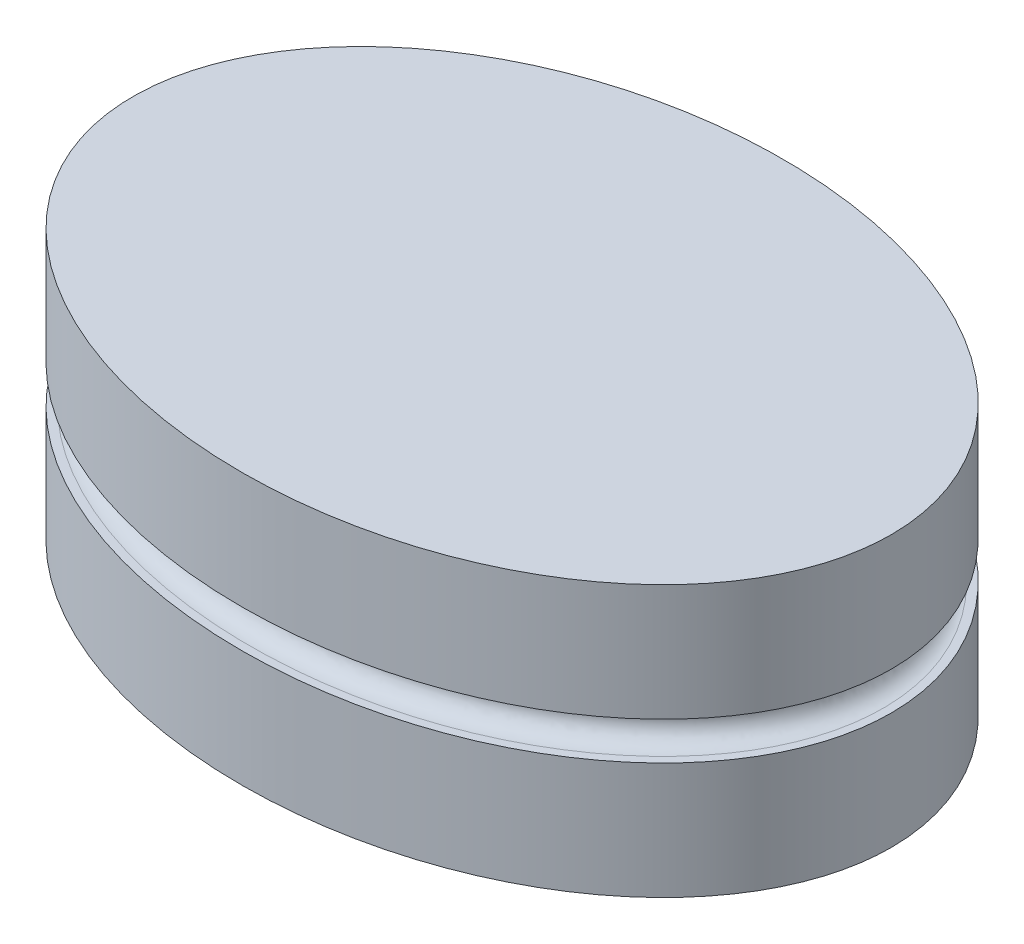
ISO-10303-21;
HEADER;
FILE_DESCRIPTION(('STEP AP214'),'2;1');
FILE_NAME('part.step','',(''),(''),'','','');
FILE_SCHEMA(('AUTOMOTIVE_DESIGN { 1 0 10303 214 1 1 1 1 }'));
ENDSEC;
DATA;
#1=APPLICATION_CONTEXT('core data for automotive mechanical design processes');
#2=APPLICATION_PROTOCOL_DEFINITION('international standard','automotive_design',2000,#1);
#3=PRODUCT_CONTEXT('',#1,'mechanical');
#4=PRODUCT('Part','Part','',(#3));
#5=PRODUCT_RELATED_PRODUCT_CATEGORY('part','',(#4));
#6=PRODUCT_DEFINITION_FORMATION('','',#4);
#7=PRODUCT_DEFINITION_CONTEXT('part definition',#1,'design');
#8=PRODUCT_DEFINITION('design','',#6,#7);
#9=PRODUCT_DEFINITION_SHAPE('','',#8);
#10=(LENGTH_UNIT() NAMED_UNIT(*) SI_UNIT(.MILLI.,.METRE.));
#11=(NAMED_UNIT(*) PLANE_ANGLE_UNIT() SI_UNIT($,.RADIAN.));
#12=(NAMED_UNIT(*) SI_UNIT($,.STERADIAN.) SOLID_ANGLE_UNIT());
#13=UNCERTAINTY_MEASURE_WITH_UNIT(LENGTH_MEASURE(1.E-05),#10,'distance_accuracy_value','');
#14=(GEOMETRIC_REPRESENTATION_CONTEXT(3) GLOBAL_UNCERTAINTY_ASSIGNED_CONTEXT((#13)) GLOBAL_UNIT_ASSIGNED_CONTEXT((#10,
#11,#12)) REPRESENTATION_CONTEXT('',''));
#15=CARTESIAN_POINT('',(0.,0.,0.));
#16=DIRECTION('',(0.,0.,1.));
#17=DIRECTION('',(1.,0.,0.));
#18=AXIS2_PLACEMENT_3D('',#15,#16,#17);
#19=CARTESIAN_POINT('',(-68.5,28.5,0.));
#20=CARTESIAN_POINT('',(-68.5,28.5,6.26980147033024));
#21=CARTESIAN_POINT('',(-66.7661290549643,28.5,12.5416490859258));
#22=CARTESIAN_POINT('',(-59.9793098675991,28.5,24.2260234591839));
#23=CARTESIAN_POINT('',(-54.956252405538,28.5,29.6135417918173));
#24=CARTESIAN_POINT('',(-42.2945741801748,28.5,38.6562274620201));
#25=CARTESIAN_POINT('',(-34.6879216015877,28.5,42.2916173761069));
#26=CARTESIAN_POINT('',(-18.0371571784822,28.5,47.2194491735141));
#27=CARTESIAN_POINT('',(-9.0263278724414,28.5,48.5000000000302));
#28=CARTESIAN_POINT('',(9.02632787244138,28.5,48.4999999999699));
#29=CARTESIAN_POINT('',(18.0371571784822,28.5,47.2194491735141));
#30=CARTESIAN_POINT('',(34.6879216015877,28.5,42.2916173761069));
#31=CARTESIAN_POINT('',(42.2945741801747,28.5,38.6562274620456));
#32=CARTESIAN_POINT('',(54.956252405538,28.5,29.6135417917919));
#33=CARTESIAN_POINT('',(59.9793098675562,28.5,24.2260234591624));
#34=CARTESIAN_POINT('',(66.7661290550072,28.5,12.5416490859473));
#35=CARTESIAN_POINT('',(68.4999999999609,28.5,6.26980147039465));
#36=CARTESIAN_POINT('',(68.5000000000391,28.5,-6.26980147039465));
#37=CARTESIAN_POINT('',(66.7661290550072,28.5,-12.5416490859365));
#38=CARTESIAN_POINT('',(59.9793098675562,28.5,-24.2260234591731));
#39=CARTESIAN_POINT('',(54.9562524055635,28.5,-29.6135417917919));
#40=CARTESIAN_POINT('',(42.2945741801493,28.5,-38.6562274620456));
#41=CARTESIAN_POINT('',(34.6879216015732,28.5,-42.2916173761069));
#42=CARTESIAN_POINT('',(18.0371571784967,28.5,-47.2194491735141));
#43=CARTESIAN_POINT('',(9.02632787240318,28.5,-48.5000000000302));
#44=CARTESIAN_POINT('',(-9.02632787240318,28.5,-48.4999999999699));
#45=CARTESIAN_POINT('',(-18.0371571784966,28.5,-47.2194491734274));
#46=CARTESIAN_POINT('',(-34.6879216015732,28.5,-42.2916173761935));
#47=CARTESIAN_POINT('',(-42.2945741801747,28.5,-38.6562274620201));
#48=CARTESIAN_POINT('',(-54.956252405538,28.5,-29.6135417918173));
#49=CARTESIAN_POINT('',(-59.9793098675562,28.5,-24.2260234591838));
#50=CARTESIAN_POINT('',(-66.7661290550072,28.5,-12.5416490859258));
#51=CARTESIAN_POINT('',(-68.5,28.5,-6.26980147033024));
#52=CARTESIAN_POINT('',(-68.5,28.5,0.));
#53=CARTESIAN_POINT('',(-66.1666666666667,28.5,0.));
#54=CARTESIAN_POINT('',(-66.1666666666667,28.5,5.84283599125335));
#55=CARTESIAN_POINT('',(-64.5586214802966,28.5000001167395,11.6965346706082));
#56=CARTESIAN_POINT('',(-58.1514871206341,28.4999998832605,22.7272336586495));
#57=CARTESIAN_POINT('',(-53.3607530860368,28.4999999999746,27.8857165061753));
#58=CARTESIAN_POINT('',(-41.1779007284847,28.5000000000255,36.5864355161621));
#59=CARTESIAN_POINT('',(-33.7964384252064,28.5000000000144,40.122079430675));
#60=CARTESIAN_POINT('',(-17.6043100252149,28.4999999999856,44.9141768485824));
#61=CARTESIAN_POINT('',(-8.80473810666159,28.5000000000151,46.1666666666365));
#62=CARTESIAN_POINT('',(8.80473810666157,28.4999999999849,46.1666666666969));
#63=CARTESIAN_POINT('',(17.6043100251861,28.5000000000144,44.9141768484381));
#64=CARTESIAN_POINT('',(33.7964384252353,28.4999999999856,40.1220794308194));
#65=CARTESIAN_POINT('',(41.1779007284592,28.5,36.5864355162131));
#66=CARTESIAN_POINT('',(53.3607530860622,28.5,27.8857165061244));
#67=CARTESIAN_POINT('',(58.1514871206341,28.499999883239,22.7272336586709));
#68=CARTESIAN_POINT('',(64.5586214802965,28.500000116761,11.6965346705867));
#69=CARTESIAN_POINT('',(66.1666666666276,28.5,5.84283599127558));
#70=CARTESIAN_POINT('',(66.1666666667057,28.5,-5.84283599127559));
#71=CARTESIAN_POINT('',(64.5586214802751,28.500000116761,-11.6965346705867));
#72=CARTESIAN_POINT('',(58.1514871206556,28.499999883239,-22.7272336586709));
#73=CARTESIAN_POINT('',(53.3607530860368,28.4999999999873,-27.8857165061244));
#74=CARTESIAN_POINT('',(41.1779007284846,28.5000000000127,-36.5864355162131));
#75=CARTESIAN_POINT('',(33.7964384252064,28.4999999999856,-40.1220794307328));
#76=CARTESIAN_POINT('',(17.6043100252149,28.5000000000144,-44.9141768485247));
#77=CARTESIAN_POINT('',(8.80473810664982,28.5000000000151,-46.1666666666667));
#78=CARTESIAN_POINT('',(-8.80473810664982,28.4999999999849,-46.1666666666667));
#79=CARTESIAN_POINT('',(-17.6043100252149,28.4999999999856,-44.914176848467));
#80=CARTESIAN_POINT('',(-33.7964384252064,28.5000000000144,-40.1220794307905));
#81=CARTESIAN_POINT('',(-41.1779007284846,28.4999999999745,-36.5864355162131));
#82=CARTESIAN_POINT('',(-53.3607530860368,28.5000000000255,-27.8857165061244));
#83=CARTESIAN_POINT('',(-58.1514871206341,28.4999998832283,-22.7272336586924));
#84=CARTESIAN_POINT('',(-64.5586214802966,28.5000001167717,-11.6965346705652));
#85=CARTESIAN_POINT('',(-66.1666666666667,28.5,-5.84283599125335));
#86=CARTESIAN_POINT('',(-66.1666666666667,28.5,0.));
#87=CARTESIAN_POINT('',(-63.25,26.75,0.));
#88=CARTESIAN_POINT('',(-63.25,26.75,5.30912914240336));
#89=CARTESIAN_POINT('',(-61.7992368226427,26.7500001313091,10.6401415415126));
#90=CARTESIAN_POINT('',(-55.8667088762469,26.7499998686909,20.85374651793));
#91=CARTESIAN_POINT('',(-51.3663789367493,26.7499999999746,25.7259348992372));
#92=CARTESIAN_POINT('',(-39.7820589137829,26.7500000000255,33.9991955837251));
#93=CARTESIAN_POINT('',(-32.6820844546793,26.7499999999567,37.4101569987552));
#94=CARTESIAN_POINT('',(-17.0632510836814,26.7500000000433,42.0325864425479));
#95=CARTESIAN_POINT('',(-8.52775089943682,26.7499999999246,43.2499999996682));
#96=CARTESIAN_POINT('',(8.52775089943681,26.7500000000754,43.2500000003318));
#97=CARTESIAN_POINT('',(17.0632510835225,26.7499999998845,42.0325864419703));
#98=CARTESIAN_POINT('',(32.6820844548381,26.7500000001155,37.4101569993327));
#99=CARTESIAN_POINT('',(39.7820589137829,26.7499999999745,33.9991955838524));
#100=CARTESIAN_POINT('',(51.3663789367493,26.7500000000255,25.72593489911));
#101=CARTESIAN_POINT('',(55.8667088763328,26.7499998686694,20.8537465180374));
#102=CARTESIAN_POINT('',(61.7992368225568,26.7500001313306,10.6401415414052));
#103=CARTESIAN_POINT('',(63.2499999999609,26.75,5.30912914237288));
#104=CARTESIAN_POINT('',(63.2500000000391,26.75,-5.30912914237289));
#105=CARTESIAN_POINT('',(61.7992368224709,26.7500001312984,-10.6401415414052));
#106=CARTESIAN_POINT('',(55.8667088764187,26.7499998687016,-20.8537465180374));
#107=CARTESIAN_POINT('',(51.3663789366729,26.75,-25.7259348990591));
#108=CARTESIAN_POINT('',(39.7820589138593,26.75,-33.9991955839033));
#109=CARTESIAN_POINT('',(32.6820844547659,26.7499999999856,-37.4101569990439));
#110=CARTESIAN_POINT('',(17.0632510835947,26.7500000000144,-42.0325864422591));
#111=CARTESIAN_POINT('',(8.52775089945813,26.7500000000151,-43.2499999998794));
#112=CARTESIAN_POINT('',(-8.52775089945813,26.7499999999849,-43.2500000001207));
#113=CARTESIAN_POINT('',(-17.063251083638,26.75,-42.0325864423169));
#114=CARTESIAN_POINT('',(-32.6820844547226,26.75,-37.4101569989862));
#115=CARTESIAN_POINT('',(-39.7820589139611,26.7499999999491,-33.999195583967));
#116=CARTESIAN_POINT('',(-51.3663789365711,26.7500000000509,-25.7259348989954));
#117=CARTESIAN_POINT('',(-55.8667088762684,26.7499998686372,-20.8537465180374));
#118=CARTESIAN_POINT('',(-61.7992368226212,26.7500001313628,-10.6401415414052));
#119=CARTESIAN_POINT('',(-63.25,26.75,-5.30912914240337));
#120=CARTESIAN_POINT('',(-63.25,26.75,0.));
#121=CARTESIAN_POINT('',(-63.25,23.25,0.));
#122=CARTESIAN_POINT('',(-63.25,23.25,5.30912914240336));
#123=CARTESIAN_POINT('',(-61.7992368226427,23.2499998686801,10.6401415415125));
#124=CARTESIAN_POINT('',(-55.8667088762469,23.2500001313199,20.85374651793));
#125=CARTESIAN_POINT('',(-51.3663789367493,23.2500000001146,25.7259348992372));
#126=CARTESIAN_POINT('',(-39.7820589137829,23.2499999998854,33.9991955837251));
#127=CARTESIAN_POINT('',(-32.6820844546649,23.2499999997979,37.4101569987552));
#128=CARTESIAN_POINT('',(-17.0632510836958,23.2500000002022,42.0325864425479));
#129=CARTESIAN_POINT('',(-8.52775089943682,23.2499999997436,43.2499999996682));
#130=CARTESIAN_POINT('',(8.52775089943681,23.2500000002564,43.2500000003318));
#131=CARTESIAN_POINT('',(17.0632510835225,23.2499999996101,42.0325864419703));
#132=CARTESIAN_POINT('',(32.6820844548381,23.2500000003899,37.4101569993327));
#133=CARTESIAN_POINT('',(39.7820589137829,23.2499999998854,33.9991955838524));
#134=CARTESIAN_POINT('',(51.3663789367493,23.2500000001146,25.72593489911));
#135=CARTESIAN_POINT('',(55.8667088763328,23.2500001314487,20.8537465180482));
#136=CARTESIAN_POINT('',(61.7992368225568,23.2499998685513,10.6401415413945));
#137=CARTESIAN_POINT('',(63.2499999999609,23.25,5.30912914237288));
#138=CARTESIAN_POINT('',(63.2500000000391,23.25,-5.30912914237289));
#139=CARTESIAN_POINT('',(61.7992368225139,23.2499998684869,-10.6401415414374));
#140=CARTESIAN_POINT('',(55.8667088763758,23.2500001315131,-20.8537465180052));
#141=CARTESIAN_POINT('',(51.3663789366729,23.2500000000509,-25.7259348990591));
#142=CARTESIAN_POINT('',(39.7820589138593,23.2499999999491,-33.9991955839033));
#143=CARTESIAN_POINT('',(32.6820844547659,23.2500000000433,-37.4101569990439));
#144=CARTESIAN_POINT('',(17.0632510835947,23.2499999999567,-42.0325864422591));
#145=CARTESIAN_POINT('',(8.52775089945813,23.2499999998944,-43.2499999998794));
#146=CARTESIAN_POINT('',(-8.52775089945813,23.2500000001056,-43.2500000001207));
#147=CARTESIAN_POINT('',(-17.0632510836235,23.2500000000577,-42.0325864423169));
#148=CARTESIAN_POINT('',(-32.682084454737,23.2499999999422,-37.4101569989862));
#149=CARTESIAN_POINT('',(-39.7820589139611,23.2500000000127,-33.999195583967));
#150=CARTESIAN_POINT('',(-51.3663789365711,23.2499999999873,-25.7259348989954));
#151=CARTESIAN_POINT('',(-55.8667088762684,23.2500001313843,-20.8537465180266));
#152=CARTESIAN_POINT('',(-61.7992368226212,23.2499998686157,-10.6401415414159));
#153=CARTESIAN_POINT('',(-63.25,23.25,-5.30912914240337));
#154=CARTESIAN_POINT('',(-63.25,23.25,0.));
#155=CARTESIAN_POINT('',(-66.1666666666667,21.5,0.));
#156=CARTESIAN_POINT('',(-66.1666666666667,21.5,5.84283599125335));
#157=CARTESIAN_POINT('',(-64.5586214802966,21.4999998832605,11.6965346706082));
#158=CARTESIAN_POINT('',(-58.1514871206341,21.5000001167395,22.7272336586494));
#159=CARTESIAN_POINT('',(-53.3607530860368,21.5000000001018,27.8857165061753));
#160=CARTESIAN_POINT('',(-41.1779007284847,21.4999999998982,36.5864355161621));
#161=CARTESIAN_POINT('',(-33.796438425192,21.4999999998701,40.122079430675));
#162=CARTESIAN_POINT('',(-17.6043100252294,21.50000000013,44.9141768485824));
#163=CARTESIAN_POINT('',(-8.80473810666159,21.4999999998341,46.1666666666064));
#164=CARTESIAN_POINT('',(8.80473810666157,21.5000000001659,46.166666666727));
#165=CARTESIAN_POINT('',(17.6043100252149,21.499999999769,44.9141768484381));
#166=CARTESIAN_POINT('',(33.7964384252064,21.500000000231,40.1220794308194));
#167=CARTESIAN_POINT('',(41.1779007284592,21.4999999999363,36.5864355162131));
#168=CARTESIAN_POINT('',(53.3607530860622,21.5000000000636,27.8857165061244));
#169=CARTESIAN_POINT('',(58.1514871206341,21.5000001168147,22.7272336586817));
#170=CARTESIAN_POINT('',(64.5586214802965,21.4999998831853,11.696534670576));
#171=CARTESIAN_POINT('',(66.1666666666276,21.5,5.84283599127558));
#172=CARTESIAN_POINT('',(66.1666666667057,21.5,-5.84283599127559));
#173=CARTESIAN_POINT('',(64.558621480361,21.4999998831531,-11.6965346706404));
#174=CARTESIAN_POINT('',(58.1514871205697,21.5000001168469,-22.7272336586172));
#175=CARTESIAN_POINT('',(53.3607530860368,21.5000000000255,-27.8857165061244));
#176=CARTESIAN_POINT('',(41.1779007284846,21.4999999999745,-36.5864355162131));
#177=CARTESIAN_POINT('',(33.7964384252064,21.5000000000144,-40.1220794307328));
#178=CARTESIAN_POINT('',(17.6043100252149,21.4999999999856,-44.9141768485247));
#179=CARTESIAN_POINT('',(8.80473810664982,21.4999999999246,-46.1666666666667));
#180=CARTESIAN_POINT('',(-8.80473810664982,21.5000000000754,-46.1666666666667));
#181=CARTESIAN_POINT('',(-17.6043100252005,21.5000000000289,-44.914176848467));
#182=CARTESIAN_POINT('',(-33.7964384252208,21.4999999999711,-40.1220794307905));
#183=CARTESIAN_POINT('',(-41.1779007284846,21.5000000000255,-36.5864355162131));
#184=CARTESIAN_POINT('',(-53.3607530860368,21.4999999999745,-27.8857165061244));
#185=CARTESIAN_POINT('',(-58.1514871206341,21.5000001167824,-22.7272336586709));
#186=CARTESIAN_POINT('',(-64.5586214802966,21.4999998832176,-11.6965346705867));
#187=CARTESIAN_POINT('',(-66.1666666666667,21.5,-5.84283599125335));
#188=CARTESIAN_POINT('',(-66.1666666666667,21.5,0.));
#189=CARTESIAN_POINT('',(-68.5,21.5,0.));
#190=CARTESIAN_POINT('',(-68.5,21.5,6.26980147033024));
#191=CARTESIAN_POINT('',(-66.7661290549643,21.5,12.5416490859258));
#192=CARTESIAN_POINT('',(-59.9793098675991,21.5,24.2260234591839));
#193=CARTESIAN_POINT('',(-54.956252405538,21.5,29.6135417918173));
#194=CARTESIAN_POINT('',(-42.2945741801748,21.5,38.6562274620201));
#195=CARTESIAN_POINT('',(-34.6879216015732,21.5,42.2916173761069));
#196=CARTESIAN_POINT('',(-18.0371571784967,21.5,47.2194491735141));
#197=CARTESIAN_POINT('',(-9.0263278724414,21.5,48.5));
#198=CARTESIAN_POINT('',(9.02632787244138,21.5,48.5));
#199=CARTESIAN_POINT('',(18.0371571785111,21.5,47.2194491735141));
#200=CARTESIAN_POINT('',(34.6879216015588,21.5,42.2916173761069));
#201=CARTESIAN_POINT('',(42.2945741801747,21.5,38.6562274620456));
#202=CARTESIAN_POINT('',(54.956252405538,21.5,29.6135417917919));
#203=CARTESIAN_POINT('',(59.9793098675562,21.5,24.2260234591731));
#204=CARTESIAN_POINT('',(66.7661290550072,21.5,12.5416490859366));
#205=CARTESIAN_POINT('',(68.4999999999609,21.5,6.26980147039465));
#206=CARTESIAN_POINT('',(68.5000000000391,21.5,-6.26980147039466));
#207=CARTESIAN_POINT('',(66.7661290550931,21.5,-12.5416490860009));
#208=CARTESIAN_POINT('',(59.9793098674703,21.5,-24.2260234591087));
#209=CARTESIAN_POINT('',(54.9562524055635,21.5,-29.6135417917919));
#210=CARTESIAN_POINT('',(42.2945741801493,21.5,-38.6562274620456));
#211=CARTESIAN_POINT('',(34.6879216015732,21.5,-42.2916173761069));
#212=CARTESIAN_POINT('',(18.0371571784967,21.5,-47.2194491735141));
#213=CARTESIAN_POINT('',(9.02632787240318,21.5,-48.5000000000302));
#214=CARTESIAN_POINT('',(-9.02632787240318,21.5,-48.4999999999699));
#215=CARTESIAN_POINT('',(-18.0371571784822,21.5,-47.2194491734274));
#216=CARTESIAN_POINT('',(-34.6879216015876,21.5,-42.2916173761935));
#217=CARTESIAN_POINT('',(-42.2945741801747,21.5,-38.6562274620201));
#218=CARTESIAN_POINT('',(-54.956252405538,21.5,-29.6135417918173));
#219=CARTESIAN_POINT('',(-59.9793098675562,21.5,-24.2260234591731));
#220=CARTESIAN_POINT('',(-66.7661290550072,21.5,-12.5416490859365));
#221=CARTESIAN_POINT('',(-68.5,21.5,-6.26980147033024));
#222=CARTESIAN_POINT('',(-68.5,21.5,0.));
#223=(BOUNDED_SURFACE() B_SPLINE_SURFACE(5,3,((#19,#20,#21,#22,#23,#24,#25,#26,#27,#28,#29,#30,
#31,#32,#33,#34,#35,#36,#37,#38,#39,#40,#41,#42,#43,#44,#45,#46,#47,#48,#49,#50,#51,#52),(#53,
#54,#55,#56,#57,#58,#59,#60,#61,#62,#63,#64,#65,#66,#67,#68,#69,#70,#71,#72,#73,#74,#75,#76,#77,
#78,#79,#80,#81,#82,#83,#84,#85,#86),(#87,#88,#89,#90,#91,#92,#93,#94,#95,#96,#97,#98,#99,#100,
#101,#102,#103,#104,#105,#106,#107,#108,#109,#110,#111,#112,#113,#114,#115,#116,#117,#118,#119,
#120),(#121,#122,#123,#124,#125,#126,#127,#128,#129,#130,#131,#132,#133,#134,#135,#136,#137,
#138,#139,#140,#141,#142,#143,#144,#145,#146,#147,#148,#149,#150,#151,#152,#153,#154),(#155,
#156,#157,#158,#159,#160,#161,#162,#163,#164,#165,#166,#167,#168,#169,#170,#171,#172,#173,#174,
#175,#176,#177,#178,#179,#180,#181,#182,#183,#184,#185,#186,#187,#188),(#189,#190,#191,#192,
#193,#194,#195,#196,#197,#198,#199,#200,#201,#202,#203,#204,#205,#206,#207,#208,#209,#210,#211,
#212,#213,#214,#215,#216,#217,#218,#219,#220,#221,#222)),.UNSPECIFIED.,.F.,.T.,
.F.) B_SPLINE_SURFACE_WITH_KNOTS((6,6),(4,2,2,2,2,2,2,2,2,2,2,2,2,2,2,2,4),(0.,1.),(0.5,0.5625,
0.625,0.6875,0.75,0.8125,0.875,0.9375,1.,1.0625,1.125,1.1875,1.25,1.3125,1.375,1.4375,1.5),
.UNSPECIFIED.) GEOMETRIC_REPRESENTATION_ITEM() RATIONAL_B_SPLINE_SURFACE(((1.,1.,1.,1.,1.,1.,1.,
1.,1.,1.,1.,1.,1.,1.,1.,1.,1.,1.,1.,1.,1.,1.,1.,1.,1.,1.,1.,1.,1.,1.,1.,1.,1.,1.),(0.6,0.6,
0.599999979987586,0.600000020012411,0.599999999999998,0.599999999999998,0.6,0.6,0.6,0.6,0.6,0.6,
0.599999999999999,0.599999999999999,0.600000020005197,0.599999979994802,0.6,0.6,
0.599999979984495,0.600000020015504,0.6,0.6,0.599999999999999,0.599999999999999,0.6,0.6,
0.599999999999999,0.599999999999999,0.599999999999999,0.599999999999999,0.600000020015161,
0.599999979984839,0.6,0.6),(0.4,0.4,0.399999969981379,0.400000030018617,0.399999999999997,
0.399999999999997,0.4,0.4,0.4,0.4,0.4,0.4,0.399999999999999,0.399999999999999,0.400000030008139,
0.39999996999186,0.4,0.4,0.39999996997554,0.400000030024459,0.4,0.4,0.399999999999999,
0.399999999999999,0.4,0.4,0.399999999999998,0.399999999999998,0.399999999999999,
0.399999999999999,0.400000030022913,0.399999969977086,0.4,0.4),(0.4,0.4,0.399999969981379,
0.400000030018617,0.399999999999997,0.399999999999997,0.4,0.4,0.4,0.4,0.4,0.4,0.399999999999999,
0.399999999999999,0.400000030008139,0.39999996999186,0.4,0.4,0.39999996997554,0.400000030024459,
0.4,0.4,0.399999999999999,0.399999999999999,0.4,0.4,0.399999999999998,0.399999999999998,
0.399999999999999,0.399999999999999,0.400000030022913,0.399999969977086,0.4,0.4),(0.6,0.6,
0.599999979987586,0.600000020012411,0.599999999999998,0.599999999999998,0.6,0.6,0.6,0.6,0.6,0.6,
0.599999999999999,0.599999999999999,0.600000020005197,0.599999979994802,0.6,0.6,
0.599999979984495,0.600000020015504,0.6,0.6,0.599999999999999,0.599999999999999,0.6,0.6,
0.599999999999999,0.599999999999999,0.599999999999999,0.599999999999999,0.600000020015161,
0.599999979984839,0.6,0.6),(1.,1.,1.,1.,1.,1.,1.,1.,1.,1.,1.,1.,1.,1.,1.,1.,1.,1.,1.,1.,1.,1.,
1.,1.,1.,1.,1.,1.,1.,1.,1.,1.,1.,1.))) REPRESENTATION_ITEM('') SURFACE());
#224=CARTESIAN_POINT('',(-68.5,28.5,0.));
#225=CARTESIAN_POINT('',(-68.5,28.5,-6.26980147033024));
#226=CARTESIAN_POINT('',(-66.7661290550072,28.5,-12.5416490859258));
#227=CARTESIAN_POINT('',(-59.9793098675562,28.5,-24.2260234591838));
#228=CARTESIAN_POINT('',(-54.956252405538,28.5,-29.6135417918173));
#229=CARTESIAN_POINT('',(-42.2945741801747,28.5,-38.6562274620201));
#230=CARTESIAN_POINT('',(-34.6879216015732,28.5,-42.2916173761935));
#231=CARTESIAN_POINT('',(-18.0371571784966,28.5,-47.2194491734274));
#232=CARTESIAN_POINT('',(-9.02632787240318,28.5,-48.4999999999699));
#233=CARTESIAN_POINT('',(9.02632787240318,28.5,-48.5000000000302));
#234=CARTESIAN_POINT('',(18.0371571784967,28.5,-47.2194491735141));
#235=CARTESIAN_POINT('',(34.6879216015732,28.5,-42.2916173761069));
#236=CARTESIAN_POINT('',(42.2945741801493,28.5,-38.6562274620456));
#237=CARTESIAN_POINT('',(54.9562524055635,28.5,-29.6135417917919));
#238=CARTESIAN_POINT('',(59.9793098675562,28.5,-24.2260234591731));
#239=CARTESIAN_POINT('',(66.7661290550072,28.5,-12.5416490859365));
#240=CARTESIAN_POINT('',(68.5000000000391,28.5,-6.26980147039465));
#241=CARTESIAN_POINT('',(68.4999999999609,28.5,6.26980147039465));
#242=CARTESIAN_POINT('',(66.7661290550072,28.5,12.5416490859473));
#243=CARTESIAN_POINT('',(59.9793098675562,28.5,24.2260234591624));
#244=CARTESIAN_POINT('',(54.956252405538,28.5,29.6135417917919));
#245=CARTESIAN_POINT('',(42.2945741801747,28.5,38.6562274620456));
#246=CARTESIAN_POINT('',(34.6879216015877,28.5,42.2916173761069));
#247=CARTESIAN_POINT('',(18.0371571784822,28.5,47.2194491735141));
#248=CARTESIAN_POINT('',(9.02632787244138,28.5,48.4999999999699));
#249=CARTESIAN_POINT('',(-9.0263278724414,28.5,48.5000000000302));
#250=CARTESIAN_POINT('',(-18.0371571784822,28.5,47.2194491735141));
#251=CARTESIAN_POINT('',(-34.6879216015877,28.5,42.2916173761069));
#252=CARTESIAN_POINT('',(-42.2945741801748,28.5,38.6562274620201));
#253=CARTESIAN_POINT('',(-54.956252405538,28.5,29.6135417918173));
#254=CARTESIAN_POINT('',(-59.9793098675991,28.5,24.2260234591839));
#255=CARTESIAN_POINT('',(-66.7661290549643,28.5,12.5416490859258));
#256=CARTESIAN_POINT('',(-68.5,28.5,6.26980147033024));
#257=CARTESIAN_POINT('',(-68.5,28.5,0.));
#258=(BOUNDED_CURVE() B_SPLINE_CURVE(3,(#224,#225,#226,#227,#228,#229,#230,#231,#232,#233,#234,
#235,#236,#237,#238,#239,#240,#241,#242,#243,#244,#245,#246,#247,#248,#249,#250,#251,#252,#253,
#254,#255,#256,#257),.UNSPECIFIED.,.T.,.F.) B_SPLINE_CURVE_WITH_KNOTS((4,2,2,2,2,2,2,2,2,2,2,2,
2,2,2,2,4),(0.5,0.5625,0.625,0.6875,0.75,0.8125,0.875,0.9375,1.,1.0625,1.125,1.1875,1.25,1.3125,
1.375,1.4375,1.5),
.UNSPECIFIED.) CURVE() GEOMETRIC_REPRESENTATION_ITEM() RATIONAL_B_SPLINE_CURVE((1.,1.,1.,1.,1.,
1.,1.,1.,1.,1.,1.,1.,1.,1.,1.,1.,1.,1.,1.,1.,1.,1.,1.,1.,1.,1.,1.,1.,1.,1.,1.,1.,1.,1.)) REPRESENTATION_ITEM(''));
#259=CARTESIAN_POINT('',(-68.5,28.5,0.));
#260=VERTEX_POINT('',#259);
#261=EDGE_CURVE('E42',#260,#260,#258,.F.);
#262=CARTESIAN_POINT('',(-68.5,21.5,0.));
#263=CARTESIAN_POINT('',(-68.5,21.5,6.26980147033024));
#264=CARTESIAN_POINT('',(-66.7661290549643,21.5,12.5416490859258));
#265=CARTESIAN_POINT('',(-59.9793098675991,21.5,24.2260234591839));
#266=CARTESIAN_POINT('',(-54.956252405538,21.5,29.6135417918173));
#267=CARTESIAN_POINT('',(-42.2945741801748,21.5,38.6562274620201));
#268=CARTESIAN_POINT('',(-34.6879216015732,21.5,42.2916173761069));
#269=CARTESIAN_POINT('',(-18.0371571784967,21.5,47.2194491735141));
#270=CARTESIAN_POINT('',(-9.0263278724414,21.5,48.5));
#271=CARTESIAN_POINT('',(9.02632787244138,21.5,48.5));
#272=CARTESIAN_POINT('',(18.0371571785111,21.5,47.2194491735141));
#273=CARTESIAN_POINT('',(34.6879216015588,21.5,42.2916173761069));
#274=CARTESIAN_POINT('',(42.2945741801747,21.5,38.6562274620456));
#275=CARTESIAN_POINT('',(54.956252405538,21.5,29.6135417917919));
#276=CARTESIAN_POINT('',(59.9793098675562,21.5,24.2260234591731));
#277=CARTESIAN_POINT('',(66.7661290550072,21.5,12.5416490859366));
#278=CARTESIAN_POINT('',(68.4999999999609,21.5,6.26980147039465));
#279=CARTESIAN_POINT('',(68.5000000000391,21.5,-6.26980147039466));
#280=CARTESIAN_POINT('',(66.7661290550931,21.5,-12.5416490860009));
#281=CARTESIAN_POINT('',(59.9793098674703,21.5,-24.2260234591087));
#282=CARTESIAN_POINT('',(54.9562524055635,21.5,-29.6135417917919));
#283=CARTESIAN_POINT('',(42.2945741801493,21.5,-38.6562274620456));
#284=CARTESIAN_POINT('',(34.6879216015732,21.5,-42.2916173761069));
#285=CARTESIAN_POINT('',(18.0371571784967,21.5,-47.2194491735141));
#286=CARTESIAN_POINT('',(9.02632787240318,21.5,-48.5000000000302));
#287=CARTESIAN_POINT('',(-9.02632787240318,21.5,-48.4999999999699));
#288=CARTESIAN_POINT('',(-18.0371571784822,21.5,-47.2194491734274));
#289=CARTESIAN_POINT('',(-34.6879216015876,21.5,-42.2916173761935));
#290=CARTESIAN_POINT('',(-42.2945741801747,21.5,-38.6562274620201));
#291=CARTESIAN_POINT('',(-54.956252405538,21.5,-29.6135417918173));
#292=CARTESIAN_POINT('',(-59.9793098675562,21.5,-24.2260234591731));
#293=CARTESIAN_POINT('',(-66.7661290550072,21.5,-12.5416490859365));
#294=CARTESIAN_POINT('',(-68.5,21.5,-6.26980147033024));
#295=CARTESIAN_POINT('',(-68.5,21.5,0.));
#296=(BOUNDED_CURVE() B_SPLINE_CURVE(3,(#262,#263,#264,#265,#266,#267,#268,#269,#270,#271,#272,
#273,#274,#275,#276,#277,#278,#279,#280,#281,#282,#283,#284,#285,#286,#287,#288,#289,#290,#291,
#292,#293,#294,#295),.UNSPECIFIED.,.T.,.F.) B_SPLINE_CURVE_WITH_KNOTS((4,2,2,2,2,2,2,2,2,2,2,2,
2,2,2,2,4),(0.5,0.5625,0.625,0.6875,0.75,0.8125,0.875,0.9375,1.,1.0625,1.125,1.1875,1.25,1.3125,
1.375,1.4375,1.5),
.UNSPECIFIED.) CURVE() GEOMETRIC_REPRESENTATION_ITEM() RATIONAL_B_SPLINE_CURVE((1.,1.,1.,1.,1.,
1.,1.,1.,1.,1.,1.,1.,1.,1.,1.,1.,1.,1.,1.,1.,1.,1.,1.,1.,1.,1.,1.,1.,1.,1.,1.,1.,1.,1.)) REPRESENTATION_ITEM(''));
#297=CARTESIAN_POINT('',(-68.5,21.5,0.));
#298=VERTEX_POINT('',#297);
#299=EDGE_CURVE('E10',#298,#298,#296,.F.);
#300=ORIENTED_EDGE('',*,*,#261,.F.);
#301=EDGE_LOOP('',(#300));
#302=FACE_BOUND('',#301,.T.);
#303=ORIENTED_EDGE('',*,*,#299,.F.);
#304=EDGE_LOOP('',(#303));
#305=FACE_BOUND('',#304,.T.);
#306=ADVANCED_FACE('F31',(#302,#305),#223,.T.);
#307=CARTESIAN_POINT('',(0.,50.,0.));
#308=DIRECTION('',(0.,1.,0.));
#309=DIRECTION('',(1.,0.,0.));
#310=AXIS2_PLACEMENT_3D('',#307,#308,#309);
#311=ELLIPSE('',#310,70.,50.);
#312=DIRECTION('',(0.,-1.,0.));
#313=VECTOR('',#312,1.);
#314=SURFACE_OF_LINEAR_EXTRUSION('',#311,#313);
#315=CARTESIAN_POINT('',(0.,0.,0.));
#316=DIRECTION('',(0.,1.,0.));
#317=DIRECTION('',(1.,0.,0.));
#318=AXIS2_PLACEMENT_3D('',#315,#316,#317);
#319=ELLIPSE('',#318,70.,50.);
#320=CARTESIAN_POINT('',(70.,0.,0.));
#321=VERTEX_POINT('',#320);
#322=EDGE_CURVE('E52',#321,#321,#319,.T.);
#323=ORIENTED_EDGE('',*,*,#322,.T.);
#324=EDGE_LOOP('',(#323));
#325=FACE_BOUND('',#324,.T.);
#326=CARTESIAN_POINT('',(0.,21.5,0.));
#327=DIRECTION('',(0.,1.,0.));
#328=DIRECTION('',(1.,0.,0.));
#329=AXIS2_PLACEMENT_3D('',#326,#327,#328);
#330=ELLIPSE('',#329,70.,50.);
#331=CARTESIAN_POINT('',(70.,21.5,0.));
#332=VERTEX_POINT('',#331);
#333=EDGE_CURVE('E57',#332,#332,#330,.T.);
#334=ORIENTED_EDGE('',*,*,#333,.F.);
#335=EDGE_LOOP('',(#334));
#336=FACE_BOUND('',#335,.T.);
#337=ADVANCED_FACE('F68',(#325,#336),#314,.F.);
#338=CARTESIAN_POINT('',(0.,0.,0.));
#339=DIRECTION('',(0.,1.,0.));
#340=DIRECTION('',(0.,0.,1.));
#341=AXIS2_PLACEMENT_3D('',#338,#339,#340);
#342=PLANE('',#341);
#343=ORIENTED_EDGE('',*,*,#322,.F.);
#344=EDGE_LOOP('',(#343));
#345=FACE_BOUND('',#344,.T.);
#346=ADVANCED_FACE('F69',(#345),#342,.F.);
#347=CARTESIAN_POINT('',(0.,21.5,0.));
#348=DIRECTION('',(0.,1.,0.));
#349=DIRECTION('',(0.,0.,1.));
#350=AXIS2_PLACEMENT_3D('',#347,#348,#349);
#351=PLANE('',#350);
#352=ORIENTED_EDGE('',*,*,#299,.T.);
#353=EDGE_LOOP('',(#352));
#354=FACE_BOUND('',#353,.T.);
#355=ORIENTED_EDGE('',*,*,#333,.T.);
#356=EDGE_LOOP('',(#355));
#357=FACE_BOUND('',#356,.T.);
#358=ADVANCED_FACE('F72',(#354,#357),#351,.T.);
#359=CARTESIAN_POINT('',(0.,28.5,0.));
#360=DIRECTION('',(0.,1.,0.));
#361=DIRECTION('',(0.,0.,1.));
#362=AXIS2_PLACEMENT_3D('',#359,#360,#361);
#363=PLANE('',#362);
#364=ORIENTED_EDGE('',*,*,#261,.T.);
#365=EDGE_LOOP('',(#364));
#366=FACE_BOUND('',#365,.T.);
#367=CARTESIAN_POINT('',(0.,28.5,0.));
#368=DIRECTION('',(0.,1.,0.));
#369=DIRECTION('',(1.,0.,0.));
#370=AXIS2_PLACEMENT_3D('',#367,#368,#369);
#371=ELLIPSE('',#370,70.,50.);
#372=CARTESIAN_POINT('',(70.,28.5,0.));
#373=VERTEX_POINT('',#372);
#374=EDGE_CURVE('E61',#373,#373,#371,.T.);
#375=ORIENTED_EDGE('',*,*,#374,.F.);
#376=EDGE_LOOP('',(#375));
#377=FACE_BOUND('',#376,.T.);
#378=ADVANCED_FACE('F76',(#366,#377),#363,.F.);
#379=CARTESIAN_POINT('',(0.,50.,0.));
#380=DIRECTION('',(0.,1.,0.));
#381=DIRECTION('',(0.,0.,1.));
#382=AXIS2_PLACEMENT_3D('',#379,#380,#381);
#383=PLANE('',#382);
#384=CARTESIAN_POINT('',(70.,50.,0.));
#385=VERTEX_POINT('',#384);
#386=EDGE_CURVE('E47',#385,#385,#311,.T.);
#387=ORIENTED_EDGE('',*,*,#386,.T.);
#388=EDGE_LOOP('',(#387));
#389=FACE_BOUND('',#388,.T.);
#390=ADVANCED_FACE('F66',(#389),#383,.T.);
#391=ORIENTED_EDGE('',*,*,#374,.T.);
#392=EDGE_LOOP('',(#391));
#393=FACE_BOUND('',#392,.T.);
#394=ORIENTED_EDGE('',*,*,#386,.F.);
#395=EDGE_LOOP('',(#394));
#396=FACE_BOUND('',#395,.T.);
#397=ADVANCED_FACE('F63',(#393,#396),#314,.F.);
#398=CLOSED_SHELL('',(#306,#337,#346,#358,#378,#390,#397));
#399=MANIFOLD_SOLID_BREP('B2',#398);
#400=ADVANCED_BREP_SHAPE_REPRESENTATION('',(#18,#399),#14);
#401=SHAPE_DEFINITION_REPRESENTATION(#9,#400);
ENDSEC;
END-ISO-10303-21;
